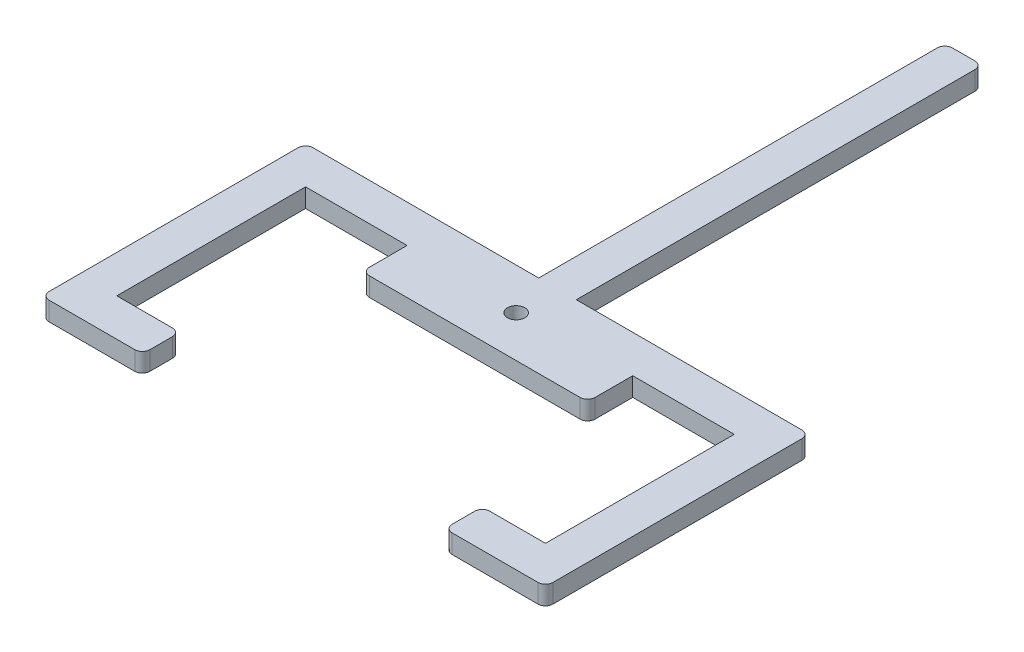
from build123d import *

# Parameters (mm, degrees)
BOSS_EXTRUDE1_DEPTH   = 3.175
SKETCH2_W             = 17.018
SKETCH2_H             = 6.35
BOSS_EXTRUDE2_DEPTH   = 3.175
F_4_CLEARANCE_HOLE1_D = 2.9464
SKETCH5_W             = 15.875
SKETCH5_H             = 4.445
BOSS_EXTRUDE3_DEPTH   = 3.175
FILLET1_R             = 1.27


with BuildPart() as part:
    # Sketch1 → Boss-Extrude1 (new body)
    with BuildSketch(Plane(origin=(0, 0, 0), x_dir=(1, 0, 0), z_dir=(0, 1, 0))):
        Polygon((0, 0), (0, -68.58), (-39.37, -68.58), (-39.37, -109.982), (-33.02, -109.982), (-33.02, -74.93), (0, -74.93), (0, -79.375), (-15.875, -79.375), (-15.875, -82.55), (22.225, -82.55), (22.225, -79.375), (6.35, -79.375), (6.35, -74.93), (39.37, -74.93), (39.37, -109.982), (45.72, -109.982), (45.72, -68.58), (6.35, -68.58), (6.35, 0), align=None)
    extrude(amount=BOSS_EXTRUDE1_DEPTH)

    # Sketch2 → Boss-Extrude2 (add)
    with BuildSketch(Plane(origin=(0, 0, 0), x_dir=(1, 0, 0), z_dir=(0, 1, 0))):
        with Locations((-30.861, -109.982)):
            Rectangle(SKETCH2_W, SKETCH2_H)
        with Locations((37.211, -109.982)):
            Rectangle(SKETCH2_W, SKETCH2_H)
    extrude(amount=BOSS_EXTRUDE2_DEPTH)

    # 4 Clearance Hole1 (through all)
    with Locations(Plane(origin=(0, 3.175, 0), x_dir=(1, 0, 0), z_dir=(0, 1, 0))):
        with Locations((3.175, -75.565)):
            Hole(F_4_CLEARANCE_HOLE1_D / 2)

    # Sketch5 → Boss-Extrude3 (add)
    with BuildSketch(Plane(origin=(0, 0, 0), x_dir=(1, 0, 0), z_dir=(0, 1, 0))):
        with Locations((-7.9375, -77.1525)):
            Rectangle(SKETCH5_W, SKETCH5_H)
        with Locations((14.2875, -77.1525)):
            Rectangle(SKETCH5_W, SKETCH5_H)
    extrude(amount=BOSS_EXTRUDE3_DEPTH)

    # Fillet1
    fillet1_edges = [part.edges().sort_by_distance(p)[0] for p in [
        (6.35, 1.5875, 0),
        (45.72, 1.5875, 68.58),
        (22.225, 1.5875, 82.55),
        (-15.875, 1.5875, 82.55),
        (-39.37, 1.5875, 68.58),
        (0, 1.5875, 0),
        (-22.352, 1.5875, 106.807),
        (-39.37, 1.5875, 113.157),
        (-22.352, 1.5875, 113.157),
        (45.72, 1.5875, 113.157),
        (28.702, 1.5875, 106.807),
        (28.702, 1.5875, 113.157),
    ]]
    fillet(fillet1_edges, radius=FILLET1_R)


solid = part.part
